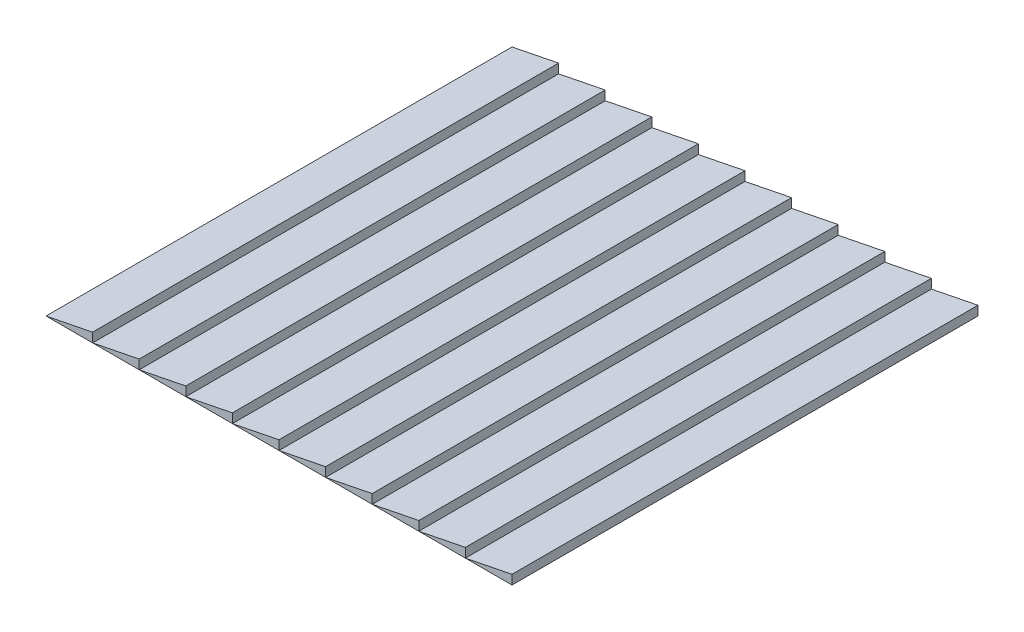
from build123d import *

# Parameters (mm, degrees)
BOSS_EXTRUDE1_DEPTH = 1000
LPATTERN1_COUNT     = 10
LPATTERN1_PITCH     = 100


with BuildPart() as part:
    # Sketch1 → Boss-Extrude1 (new body)
    with BuildSketch(Plane.XY):
        Polygon((0, 0), (0, 20), (-100, 0), align=None)
    extrude(amount=-BOSS_EXTRUDE1_DEPTH)


with BuildPart() as lpattern1_1:
    # LPattern1: pattern copy
    add(part.part.moved(Location(Vector(-1, 0, 0) * (1 * LPATTERN1_PITCH))))


with BuildPart() as lpattern1_2:
    # LPattern1: pattern copy
    add(part.part.moved(Location(Vector(-1, 0, 0) * (2 * LPATTERN1_PITCH))))


with BuildPart() as lpattern1_3:
    # LPattern1: pattern copy
    add(part.part.moved(Location(Vector(-1, 0, 0) * (3 * LPATTERN1_PITCH))))


with BuildPart() as lpattern1_4:
    # LPattern1: pattern copy
    add(part.part.moved(Location(Vector(-1, 0, 0) * (4 * LPATTERN1_PITCH))))


with BuildPart() as lpattern1_5:
    # LPattern1: pattern copy
    add(part.part.moved(Location(Vector(-1, 0, 0) * (5 * LPATTERN1_PITCH))))


with BuildPart() as lpattern1_6:
    # LPattern1: pattern copy
    add(part.part.moved(Location(Vector(-1, 0, 0) * (6 * LPATTERN1_PITCH))))


with BuildPart() as lpattern1_7:
    # LPattern1: pattern copy
    add(part.part.moved(Location(Vector(-1, 0, 0) * (7 * LPATTERN1_PITCH))))


with BuildPart() as lpattern1_8:
    # LPattern1: pattern copy
    add(part.part.moved(Location(Vector(-1, 0, 0) * (8 * LPATTERN1_PITCH))))


with BuildPart() as lpattern1_9:
    # LPattern1: pattern copy
    add(part.part.moved(Location(Vector(-1, 0, 0) * (9 * LPATTERN1_PITCH))))


solid = Compound([part.part, lpattern1_1.part, lpattern1_2.part, lpattern1_3.part, lpattern1_4.part, lpattern1_5.part, lpattern1_6.part, lpattern1_7.part, lpattern1_8.part, lpattern1_9.part])
